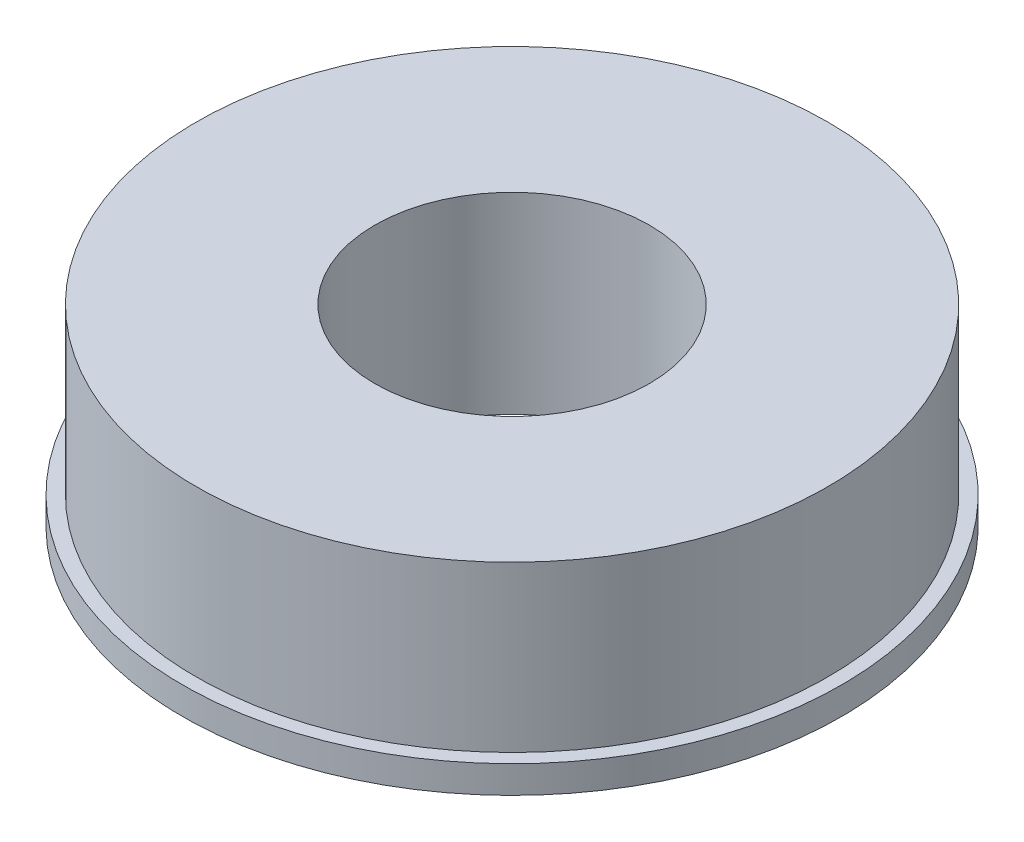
from build123d import *


with BuildPart() as part:
    # Sketch1 → Revolve1 (revolve)
    with BuildSketch(Plane.XY, mode=Mode.PRIVATE) as revolve1_sk:
        Polygon((5, 0), (12, 0), (12, 1), (11.5, 1), (11.5, 7), (5, 7), align=None)
    revolve(revolve1_sk.sketch.rotate(Axis((0, 7, 0), (0, -1, 0)), 270), axis=Axis((0, 7, 0), (0, -1, 0)))


solid = part.part
